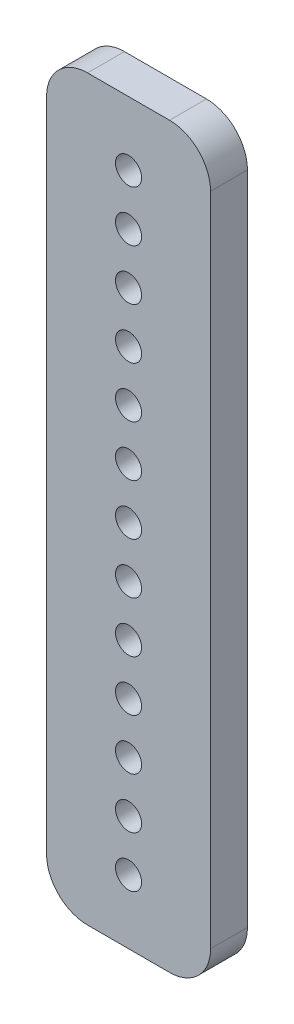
from build123d import *

# Parameters (mm, degrees)
SKETCH1_W           = 25.4
SKETCH1_H           = 114.3
BOSS_EXTRUDE1_DEPTH = 5.715
SKETCH2_R           = 2.0193
CUT_EXTRUDE1_DEPTH  = 5.715
FILLET1_R           = 6.35


with BuildPart() as part:
    # Sketch1 → Boss-Extrude1 (new body)
    with BuildSketch(Plane.XY):
        Rectangle(SKETCH1_W, SKETCH1_H)
    extrude(amount=BOSS_EXTRUDE1_DEPTH)

    # Sketch2 → Cut-Extrude1 (cut)
    with BuildSketch(Plane.XY.offset(5.715)):
        Circle(SKETCH2_R)
        with Locations((0, 7.874)):
            Circle(SKETCH2_R)
        with Locations((0, 15.748)):
            Circle(SKETCH2_R)
        with Locations((0, 23.622)):
            Circle(SKETCH2_R)
        with Locations((0, 31.496)):
            Circle(SKETCH2_R)
        with Locations((0, 39.37)):
            Circle(SKETCH2_R)
        with Locations((0, 47.244)):
            Circle(SKETCH2_R)
        with Locations((0, -7.874)):
            Circle(SKETCH2_R)
        with Locations((0, -15.748)):
            Circle(SKETCH2_R)
        with Locations((0, -23.622)):
            Circle(SKETCH2_R)
        with Locations((0, -31.496)):
            Circle(SKETCH2_R)
        with Locations((0, -39.37)):
            Circle(SKETCH2_R)
        with Locations((0, -47.244)):
            Circle(SKETCH2_R)
    extrude(amount=-CUT_EXTRUDE1_DEPTH, mode=Mode.SUBTRACT)

    # Fillet1
    fillet1_edges = [part.edges().sort_by_distance(p)[0] for p in [
        (12.7, -57.15, 2.8575),
        (-12.7, -57.15, 2.8575),
        (-12.7, 57.15, 2.8575),
        (12.7, 57.15, 2.8575),
    ]]
    fillet(fillet1_edges, radius=FILLET1_R)


solid = part.part
